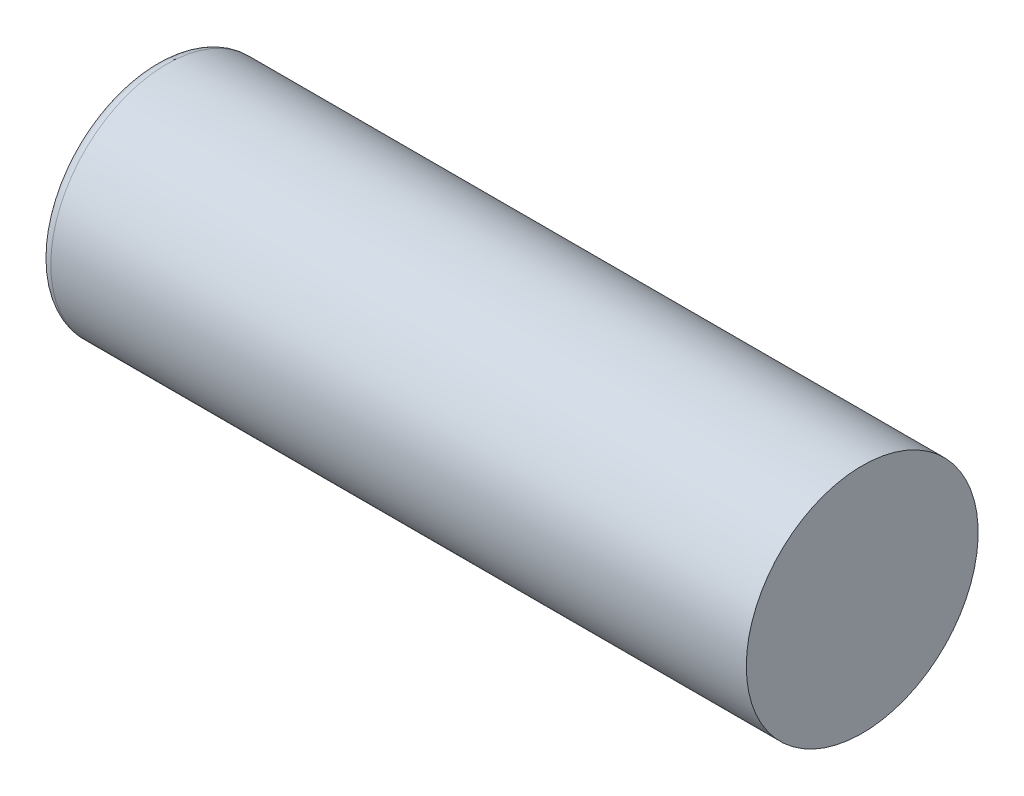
ISO-10303-21;
HEADER;
FILE_DESCRIPTION(('STEP AP214'),'2;1');
FILE_NAME('part.step','',(''),(''),'','','');
FILE_SCHEMA(('AUTOMOTIVE_DESIGN { 1 0 10303 214 1 1 1 1 }'));
ENDSEC;
DATA;
#1=APPLICATION_CONTEXT('core data for automotive mechanical design processes');
#2=APPLICATION_PROTOCOL_DEFINITION('international standard','automotive_design',2000,#1);
#3=PRODUCT_CONTEXT('',#1,'mechanical');
#4=PRODUCT('Part','Part','',(#3));
#5=PRODUCT_RELATED_PRODUCT_CATEGORY('part','',(#4));
#6=PRODUCT_DEFINITION_FORMATION('','',#4);
#7=PRODUCT_DEFINITION_CONTEXT('part definition',#1,'design');
#8=PRODUCT_DEFINITION('design','',#6,#7);
#9=PRODUCT_DEFINITION_SHAPE('','',#8);
#10=(LENGTH_UNIT() NAMED_UNIT(*) SI_UNIT(.MILLI.,.METRE.));
#11=(NAMED_UNIT(*) PLANE_ANGLE_UNIT() SI_UNIT($,.RADIAN.));
#12=(NAMED_UNIT(*) SI_UNIT($,.STERADIAN.) SOLID_ANGLE_UNIT());
#13=UNCERTAINTY_MEASURE_WITH_UNIT(LENGTH_MEASURE(1.E-05),#10,'distance_accuracy_value','');
#14=(GEOMETRIC_REPRESENTATION_CONTEXT(3) GLOBAL_UNCERTAINTY_ASSIGNED_CONTEXT((#13)) GLOBAL_UNIT_ASSIGNED_CONTEXT((#10,
#11,#12)) REPRESENTATION_CONTEXT('',''));
#15=CARTESIAN_POINT('',(0.,0.,0.));
#16=DIRECTION('',(0.,0.,1.));
#17=DIRECTION('',(1.,0.,0.));
#18=AXIS2_PLACEMENT_3D('',#15,#16,#17);
#19=CARTESIAN_POINT('',(25.,-5.5768,5.566));
#20=DIRECTION('',(1.,0.,0.));
#21=DIRECTION('',(0.,0.,-1.));
#22=AXIS2_PLACEMENT_3D('',#19,#20,#21);
#23=PLANE('',#22);
#24=DIRECTION('',(0.,-1.,0.));
#25=VECTOR('',#24,1.);
#26=CARTESIAN_POINT('',(25.,6.2117376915,-2.));
#27=LINE('',#26,#25);
#28=CARTESIAN_POINT('',(25.,7.3,-2.));
#29=VERTEX_POINT('',#28);
#30=CARTESIAN_POINT('',(25.,5.12347538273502,-2.00000000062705));
#31=VERTEX_POINT('',#30);
#32=EDGE_CURVE('E68',#29,#31,#27,.T.);
#33=ORIENTED_EDGE('',*,*,#32,.T.);
#34=CARTESIAN_POINT('',(25.,0.,0.));
#35=DIRECTION('',(-1.,0.,0.));
#36=DIRECTION('',(0.,0.,1.));
#37=AXIS2_PLACEMENT_3D('',#34,#35,#36);
#38=CIRCLE('',#37,5.5);
#39=CARTESIAN_POINT('',(25.,5.1234753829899,2.));
#40=VERTEX_POINT('',#39);
#41=EDGE_CURVE('E20',#40,#31,#38,.F.);
#42=ORIENTED_EDGE('',*,*,#41,.F.);
#43=DIRECTION('',(0.,1.,0.));
#44=VECTOR('',#43,1.);
#45=CARTESIAN_POINT('',(25.,6.2117376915,2.));
#46=LINE('',#45,#44);
#47=CARTESIAN_POINT('',(25.,7.3,2.));
#48=VERTEX_POINT('',#47);
#49=EDGE_CURVE('E66',#40,#48,#46,.T.);
#50=ORIENTED_EDGE('',*,*,#49,.T.);
#51=DIRECTION('',(0.,0.,-1.));
#52=VECTOR('',#51,1.);
#53=CARTESIAN_POINT('',(25.,7.3,0.));
#54=LINE('',#53,#52);
#55=EDGE_CURVE('E70',#48,#29,#54,.T.);
#56=ORIENTED_EDGE('',*,*,#55,.T.);
#57=EDGE_LOOP('',(#33,#42,#50,#56));
#58=FACE_BOUND('',#57,.T.);
#59=ADVANCED_FACE('F16',(#58),#23,.F.);
#60=CARTESIAN_POINT('',(0.,5.123475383,-2.));
#61=DIRECTION('',(0.,0.,-1.));
#62=DIRECTION('',(0.,1.,0.));
#63=AXIS2_PLACEMENT_3D('',#60,#61,#62);
#64=PLANE('',#63);
#65=DIRECTION('',(0.,-1.,0.));
#66=VECTOR('',#65,1.);
#67=CARTESIAN_POINT('',(0.,0.,-1.999999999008));
#68=LINE('',#67,#66);
#69=CARTESIAN_POINT('',(0.,7.29999999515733,-1.999999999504));
#70=VERTEX_POINT('',#69);
#71=CARTESIAN_POINT('',(0.,5.12347538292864,-2.00000000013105));
#72=VERTEX_POINT('',#71);
#73=EDGE_CURVE('E78',#70,#72,#68,.T.);
#74=ORIENTED_EDGE('',*,*,#73,.T.);
#75=DIRECTION('',(1.,0.,0.));
#76=VECTOR('',#75,1.);
#77=CARTESIAN_POINT('',(12.5,5.12347538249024,-2.00000000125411));
#78=LINE('',#77,#76);
#79=EDGE_CURVE('E62',#31,#72,#78,.F.);
#80=ORIENTED_EDGE('',*,*,#79,.F.);
#81=ORIENTED_EDGE('',*,*,#32,.F.);
#82=DIRECTION('',(-1.,0.,0.));
#83=VECTOR('',#82,1.);
#84=CARTESIAN_POINT('',(12.5,7.3,-2.));
#85=LINE('',#84,#83);
#86=EDGE_CURVE('E88',#29,#70,#85,.T.);
#87=ORIENTED_EDGE('',*,*,#86,.T.);
#88=EDGE_LOOP('',(#74,#80,#81,#87));
#89=FACE_BOUND('',#88,.T.);
#90=ADVANCED_FACE('F76',(#89),#64,.F.);
#91=CARTESIAN_POINT('',(25.,0.,0.));
#92=DIRECTION('',(-1.,0.,0.));
#93=DIRECTION('',(0.,0.,1.));
#94=AXIS2_PLACEMENT_3D('',#91,#92,#93);
#95=CYLINDRICAL_SURFACE('',#94,5.5);
#96=CARTESIAN_POINT('',(0.,0.,0.));
#97=DIRECTION('',(-1.,0.,0.));
#98=DIRECTION('',(0.,0.,1.));
#99=AXIS2_PLACEMENT_3D('',#96,#97,#98);
#100=CIRCLE('',#99,5.5);
#101=CARTESIAN_POINT('',(0.,5.12347538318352,1.999999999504));
#102=VERTEX_POINT('',#101);
#103=EDGE_CURVE('E107',#72,#102,#100,.T.);
#104=ORIENTED_EDGE('',*,*,#103,.T.);
#105=DIRECTION('',(1.,0.,0.));
#106=VECTOR('',#105,1.);
#107=CARTESIAN_POINT('',(12.5,5.123475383,2.));
#108=LINE('',#107,#106);
#109=EDGE_CURVE('E63',#102,#40,#108,.T.);
#110=ORIENTED_EDGE('',*,*,#109,.T.);
#111=ORIENTED_EDGE('',*,*,#41,.T.);
#112=ORIENTED_EDGE('',*,*,#79,.T.);
#113=EDGE_LOOP('',(#104,#110,#111,#112));
#114=FACE_BOUND('',#113,.T.);
#115=ADVANCED_FACE('F60',(#114),#95,.F.);
#116=CARTESIAN_POINT('',(0.,7.3,2.));
#117=DIRECTION('',(0.,0.,1.));
#118=DIRECTION('',(0.,-1.,0.));
#119=AXIS2_PLACEMENT_3D('',#116,#117,#118);
#120=PLANE('',#119);
#121=DIRECTION('',(0.,1.,0.));
#122=VECTOR('',#121,1.);
#123=CARTESIAN_POINT('',(0.,0.,1.999999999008));
#124=LINE('',#123,#122);
#125=CARTESIAN_POINT('',(0.,7.29999999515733,1.99999999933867));
#126=VERTEX_POINT('',#125);
#127=EDGE_CURVE('E36',#102,#126,#124,.T.);
#128=ORIENTED_EDGE('',*,*,#127,.T.);
#129=DIRECTION('',(1.,0.,0.));
#130=VECTOR('',#129,1.);
#131=CARTESIAN_POINT('',(12.5,7.3,2.));
#132=LINE('',#131,#130);
#133=EDGE_CURVE('E91',#126,#48,#132,.T.);
#134=ORIENTED_EDGE('',*,*,#133,.T.);
#135=ORIENTED_EDGE('',*,*,#49,.F.);
#136=ORIENTED_EDGE('',*,*,#109,.F.);
#137=EDGE_LOOP('',(#128,#134,#135,#136));
#138=FACE_BOUND('',#137,.T.);
#139=ADVANCED_FACE('F192',(#138),#120,.F.);
#140=CARTESIAN_POINT('',(0.,7.3,-2.));
#141=DIRECTION('',(0.,1.,0.));
#142=DIRECTION('',(0.,0.,1.));
#143=AXIS2_PLACEMENT_3D('',#140,#141,#142);
#144=PLANE('',#143);
#145=DIRECTION('',(0.,0.,-1.));
#146=VECTOR('',#145,1.);
#147=CARTESIAN_POINT('',(0.,7.299999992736,0.));
#148=LINE('',#147,#146);
#149=EDGE_CURVE('E106',#126,#70,#148,.T.);
#150=ORIENTED_EDGE('',*,*,#149,.T.);
#151=ORIENTED_EDGE('',*,*,#86,.F.);
#152=ORIENTED_EDGE('',*,*,#55,.F.);
#153=ORIENTED_EDGE('',*,*,#133,.F.);
#154=EDGE_LOOP('',(#150,#151,#152,#153));
#155=FACE_BOUND('',#154,.T.);
#156=ADVANCED_FACE('F129',(#155),#144,.F.);
#157=CARTESIAN_POINT('',(0.,-9.108,9.108));
#158=DIRECTION('',(1.,0.,0.));
#159=DIRECTION('',(0.,0.,-1.));
#160=AXIS2_PLACEMENT_3D('',#157,#158,#159);
#161=PLANE('',#160);
#162=ORIENTED_EDGE('',*,*,#127,.F.);
#163=ORIENTED_EDGE('',*,*,#103,.F.);
#164=ORIENTED_EDGE('',*,*,#73,.F.);
#165=ORIENTED_EDGE('',*,*,#149,.F.);
#166=EDGE_LOOP('',(#162,#163,#164,#165));
#167=FACE_BOUND('',#166,.T.);
#168=CARTESIAN_POINT('',(0.,0.,0.));
#169=DIRECTION('',(-1.,0.,0.));
#170=DIRECTION('',(0.,0.,1.));
#171=AXIS2_PLACEMENT_3D('',#168,#169,#170);
#172=CIRCLE('',#171,9.);
#173=CARTESIAN_POINT('',(0.,0.,9.));
#174=VERTEX_POINT('',#173);
#175=EDGE_CURVE('E103',#174,#174,#172,.F.);
#176=ORIENTED_EDGE('',*,*,#175,.F.);
#177=EDGE_LOOP('',(#176));
#178=FACE_BOUND('',#177,.T.);
#179=ADVANCED_FACE('F131',(#167,#178),#161,.F.);
#180=CARTESIAN_POINT('',(1.,0.,0.));
#181=DIRECTION('',(-1.,0.,0.));
#182=DIRECTION('',(0.,0.,1.));
#183=AXIS2_PLACEMENT_3D('',#180,#181,#182);
#184=TOROIDAL_SURFACE('',#183,9.,1.);
#185=ORIENTED_EDGE('',*,*,#175,.T.);
#186=EDGE_LOOP('',(#185));
#187=FACE_BOUND('',#186,.T.);
#188=CARTESIAN_POINT('',(1.,0.,0.));
#189=DIRECTION('',(-1.,0.,0.));
#190=DIRECTION('',(0.,0.,1.));
#191=AXIS2_PLACEMENT_3D('',#188,#189,#190);
#192=CIRCLE('',#191,10.);
#193=CARTESIAN_POINT('',(1.,0.,10.));
#194=VERTEX_POINT('',#193);
#195=EDGE_CURVE('E27',#194,#194,#192,.T.);
#196=ORIENTED_EDGE('',*,*,#195,.T.);
#197=EDGE_LOOP('',(#196));
#198=FACE_BOUND('',#197,.T.);
#199=ADVANCED_FACE('F134',(#187,#198),#184,.T.);
#200=CARTESIAN_POINT('',(61.,-10.12,-10.12));
#201=DIRECTION('',(-1.,0.,0.));
#202=DIRECTION('',(0.,0.,1.));
#203=AXIS2_PLACEMENT_3D('',#200,#201,#202);
#204=PLANE('',#203);
#205=CARTESIAN_POINT('',(61.,0.,0.));
#206=DIRECTION('',(-1.,0.,0.));
#207=DIRECTION('',(0.,0.,1.));
#208=AXIS2_PLACEMENT_3D('',#205,#206,#207);
#209=CIRCLE('',#208,10.);
#210=CARTESIAN_POINT('',(61.,0.,10.));
#211=VERTEX_POINT('',#210);
#212=EDGE_CURVE('E11',#211,#211,#209,.F.);
#213=ORIENTED_EDGE('',*,*,#212,.T.);
#214=EDGE_LOOP('',(#213));
#215=FACE_BOUND('',#214,.T.);
#216=ADVANCED_FACE('F18',(#215),#204,.F.);
#217=CARTESIAN_POINT('',(61.,0.,0.));
#218=DIRECTION('',(-1.,0.,0.));
#219=DIRECTION('',(0.,0.,1.));
#220=AXIS2_PLACEMENT_3D('',#217,#218,#219);
#221=CYLINDRICAL_SURFACE('',#220,10.);
#222=ORIENTED_EDGE('',*,*,#195,.F.);
#223=EDGE_LOOP('',(#222));
#224=FACE_BOUND('',#223,.T.);
#225=ORIENTED_EDGE('',*,*,#212,.F.);
#226=EDGE_LOOP('',(#225));
#227=FACE_BOUND('',#226,.T.);
#228=ADVANCED_FACE('F142',(#224,#227),#221,.T.);
#229=CLOSED_SHELL('',(#59,#90,#115,#139,#156,#179,#199,#216,#228));
#230=MANIFOLD_SOLID_BREP('B1',#229);
#231=ADVANCED_BREP_SHAPE_REPRESENTATION('',(#18,#230),#14);
#232=SHAPE_DEFINITION_REPRESENTATION(#9,#231);
ENDSEC;
END-ISO-10303-21;
